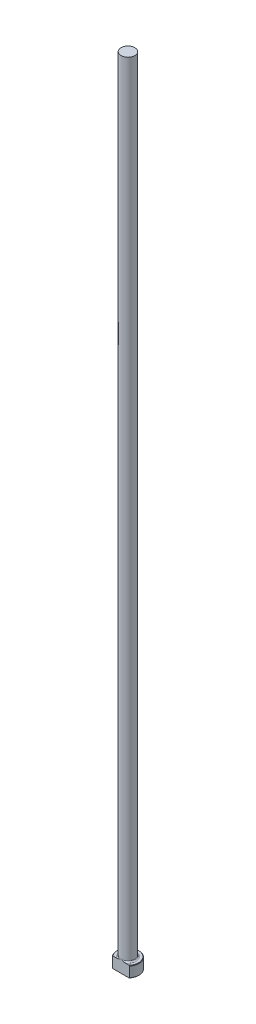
ISO-10303-21;
HEADER;
FILE_DESCRIPTION(('STEP AP214'),'2;1');
FILE_NAME('part.step','',(''),(''),'','','');
FILE_SCHEMA(('AUTOMOTIVE_DESIGN { 1 0 10303 214 1 1 1 1 }'));
ENDSEC;
DATA;
#1=APPLICATION_CONTEXT('core data for automotive mechanical design processes');
#2=APPLICATION_PROTOCOL_DEFINITION('international standard','automotive_design',2000,#1);
#3=PRODUCT_CONTEXT('',#1,'mechanical');
#4=PRODUCT('Part','Part','',(#3));
#5=PRODUCT_RELATED_PRODUCT_CATEGORY('part','',(#4));
#6=PRODUCT_DEFINITION_FORMATION('','',#4);
#7=PRODUCT_DEFINITION_CONTEXT('part definition',#1,'design');
#8=PRODUCT_DEFINITION('design','',#6,#7);
#9=PRODUCT_DEFINITION_SHAPE('','',#8);
#10=(LENGTH_UNIT() NAMED_UNIT(*) SI_UNIT(.MILLI.,.METRE.));
#11=(NAMED_UNIT(*) PLANE_ANGLE_UNIT() SI_UNIT($,.RADIAN.));
#12=(NAMED_UNIT(*) SI_UNIT($,.STERADIAN.) SOLID_ANGLE_UNIT());
#13=UNCERTAINTY_MEASURE_WITH_UNIT(LENGTH_MEASURE(1.E-05),#10,'distance_accuracy_value','');
#14=(GEOMETRIC_REPRESENTATION_CONTEXT(3) GLOBAL_UNCERTAINTY_ASSIGNED_CONTEXT((#13)) GLOBAL_UNIT_ASSIGNED_CONTEXT((#10,
#11,#12)) REPRESENTATION_CONTEXT('',''));
#15=CARTESIAN_POINT('',(0.,0.,0.));
#16=DIRECTION('',(0.,0.,1.));
#17=DIRECTION('',(1.,0.,0.));
#18=AXIS2_PLACEMENT_3D('',#15,#16,#17);
#19=CARTESIAN_POINT('',(0.,0.,0.));
#20=DIRECTION('',(0.,-1.,0.));
#21=DIRECTION('',(0.,0.,-1.));
#22=AXIS2_PLACEMENT_3D('',#19,#20,#21);
#23=PLANE('',#22);
#24=CARTESIAN_POINT('',(0.,0.,0.));
#25=DIRECTION('',(0.,-1.,0.));
#26=DIRECTION('',(0.,0.,-1.));
#27=AXIS2_PLACEMENT_3D('',#24,#25,#26);
#28=CIRCLE('',#27,6.09599999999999);
#29=CARTESIAN_POINT('',(-4.62711999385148,0.,3.96874999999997));
#30=VERTEX_POINT('',#29);
#31=CARTESIAN_POINT('',(4.62711999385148,0.,3.96874999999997));
#32=VERTEX_POINT('',#31);
#33=EDGE_CURVE('E98',#30,#32,#28,.T.);
#34=ORIENTED_EDGE('',*,*,#33,.T.);
#35=DIRECTION('',(-1.,0.,0.));
#36=VECTOR('',#35,1.);
#37=CARTESIAN_POINT('',(-4.95696716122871,0.,3.96874999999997));
#38=LINE('',#37,#36);
#39=EDGE_CURVE('E83',#32,#30,#38,.T.);
#40=ORIENTED_EDGE('',*,*,#39,.T.);
#41=EDGE_LOOP('',(#34,#40));
#42=FACE_BOUND('',#41,.T.);
#43=ADVANCED_FACE('F32',(#42),#23,.T.);
#44=CARTESIAN_POINT('',(0.,259.958771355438,0.));
#45=DIRECTION('',(0.,1.,0.));
#46=DIRECTION('',(0.,0.,1.));
#47=AXIS2_PLACEMENT_3D('',#44,#45,#46);
#48=CYLINDRICAL_SURFACE('',#47,6.34999999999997);
#49=CARTESIAN_POINT('',(0.,6.09599999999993,0.));
#50=DIRECTION('',(0.,1.,0.));
#51=DIRECTION('',(0.,0.,1.));
#52=AXIS2_PLACEMENT_3D('',#49,#50,#51);
#53=CIRCLE('',#52,6.34999999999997);
#54=CARTESIAN_POINT('',(-4.95696716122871,6.09599999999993,3.96874999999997));
#55=VERTEX_POINT('',#54);
#56=CARTESIAN_POINT('',(4.95696716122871,6.09599999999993,3.96874999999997));
#57=VERTEX_POINT('',#56);
#58=EDGE_CURVE('E104',#55,#57,#53,.F.);
#59=ORIENTED_EDGE('',*,*,#58,.T.);
#60=DIRECTION('',(0.,-1.,0.));
#61=VECTOR('',#60,1.);
#62=CARTESIAN_POINT('',(4.95696716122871,457.2,3.96874999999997));
#63=LINE('',#62,#61);
#64=CARTESIAN_POINT('',(4.95696716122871,0.253999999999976,3.96874999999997));
#65=VERTEX_POINT('',#64);
#66=EDGE_CURVE('E183',#57,#65,#63,.T.);
#67=ORIENTED_EDGE('',*,*,#66,.T.);
#68=CARTESIAN_POINT('',(0.,0.253999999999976,0.));
#69=DIRECTION('',(0.,-1.,0.));
#70=DIRECTION('',(0.,0.,-1.));
#71=AXIS2_PLACEMENT_3D('',#68,#69,#70);
#72=CIRCLE('',#71,6.34999999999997);
#73=CARTESIAN_POINT('',(-4.95696716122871,0.253999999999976,3.96874999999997));
#74=VERTEX_POINT('',#73);
#75=EDGE_CURVE('E100',#65,#74,#72,.F.);
#76=ORIENTED_EDGE('',*,*,#75,.T.);
#77=DIRECTION('',(0.,-1.,0.));
#78=VECTOR('',#77,1.);
#79=CARTESIAN_POINT('',(-4.95696716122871,457.2,3.96874999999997));
#80=LINE('',#79,#78);
#81=EDGE_CURVE('E93',#55,#74,#80,.T.);
#82=ORIENTED_EDGE('',*,*,#81,.F.);
#83=EDGE_LOOP('',(#59,#67,#76,#82));
#84=FACE_BOUND('',#83,.T.);
#85=ADVANCED_FACE('F158',(#84),#48,.T.);
#86=CARTESIAN_POINT('',(-6.34999999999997,6.35,0.));
#87=DIRECTION('',(0.,1.,0.));
#88=DIRECTION('',(0.,0.,1.));
#89=AXIS2_PLACEMENT_3D('',#86,#87,#88);
#90=PLANE('',#89);
#91=CARTESIAN_POINT('',(0.,6.35,0.));
#92=DIRECTION('',(0.,1.,0.));
#93=DIRECTION('',(0.,0.,1.));
#94=AXIS2_PLACEMENT_3D('',#91,#92,#93);
#95=CIRCLE('',#94,6.09599999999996);
#96=CARTESIAN_POINT('',(4.62711999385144,6.35,3.96874999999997));
#97=VERTEX_POINT('',#96);
#98=CARTESIAN_POINT('',(-4.62711999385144,6.35,3.96874999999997));
#99=VERTEX_POINT('',#98);
#100=EDGE_CURVE('E178',#97,#99,#95,.T.);
#101=ORIENTED_EDGE('',*,*,#100,.T.);
#102=DIRECTION('',(1.,0.,0.));
#103=VECTOR('',#102,1.);
#104=CARTESIAN_POINT('',(-6.34999999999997,6.35,3.96874999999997));
#105=LINE('',#104,#103);
#106=CARTESIAN_POINT('',(-2.57468813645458,6.35000000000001,3.96874999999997));
#107=VERTEX_POINT('',#106);
#108=EDGE_CURVE('E57',#99,#107,#105,.T.);
#109=ORIENTED_EDGE('',*,*,#108,.T.);
#110=CARTESIAN_POINT('',(0.,6.35,0.));
#111=DIRECTION('',(0.,1.,0.));
#112=DIRECTION('',(0.,0.,1.));
#113=AXIS2_PLACEMENT_3D('',#110,#111,#112);
#114=CIRCLE('',#113,4.73074999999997);
#115=CARTESIAN_POINT('',(2.57468813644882,6.35000000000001,3.96874999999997));
#116=VERTEX_POINT('',#115);
#117=EDGE_CURVE('E107',#107,#116,#114,.F.);
#118=ORIENTED_EDGE('',*,*,#117,.T.);
#119=EDGE_CURVE('E136',#116,#97,#105,.T.);
#120=ORIENTED_EDGE('',*,*,#119,.T.);
#121=EDGE_LOOP('',(#101,#109,#118,#120));
#122=FACE_BOUND('',#121,.T.);
#123=ADVANCED_FACE('F147',(#122),#90,.T.);
#124=CARTESIAN_POINT('',(0.,6.35000000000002,0.));
#125=DIRECTION('',(0.,-1.,0.));
#126=DIRECTION('',(0.,0.,-1.));
#127=AXIS2_PLACEMENT_3D('',#124,#125,#126);
#128=CONICAL_SURFACE('',#127,6.09599999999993,0.785398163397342);
#129=ORIENTED_EDGE('',*,*,#58,.F.);
#130=CARTESIAN_POINT('',(-10.9074797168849,0.838929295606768,3.96874999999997));
#131=CARTESIAN_POINT('',(-10.7362098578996,0.99987353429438,3.96874999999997));
#132=CARTESIAN_POINT('',(-10.5647219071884,1.16058556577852,3.96874999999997));
#133=CARTESIAN_POINT('',(-10.2212389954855,1.48146888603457,3.96874999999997));
#134=CARTESIAN_POINT('',(-10.0492440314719,1.64164017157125,3.96874999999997));
#135=CARTESIAN_POINT('',(-9.53215723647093,2.12144657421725,3.96874999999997));
#136=CARTESIAN_POINT('',(-9.18620012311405,2.44015148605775,3.96874999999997));
#137=CARTESIAN_POINT('',(-8.48250908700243,3.08209947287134,3.96874999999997));
#138=CARTESIAN_POINT('',(-8.12469692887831,3.40525689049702,3.96874999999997));
#139=CARTESIAN_POINT('',(-7.40476794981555,4.04632494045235,3.96874999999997));
#140=CARTESIAN_POINT('',(-7.04265387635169,4.36423864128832,3.96874999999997));
#141=CARTESIAN_POINT('',(-6.49464785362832,4.83529502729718,3.96874999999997));
#142=CARTESIAN_POINT('',(-6.31122194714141,4.99130476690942,3.96874999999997));
#143=CARTESIAN_POINT('',(-5.94233504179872,5.30091560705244,3.96874999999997));
#144=CARTESIAN_POINT('',(-5.75687398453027,5.45451663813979,3.96874999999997));
#145=CARTESIAN_POINT('',(-5.38307682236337,5.75894505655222,3.96874999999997));
#146=CARTESIAN_POINT('',(-5.19473578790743,5.90976640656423,3.96874999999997));
#147=CARTESIAN_POINT('',(-4.81490900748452,6.20737957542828,3.96874999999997));
#148=CARTESIAN_POINT('',(-4.6234235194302,6.354171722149,3.96874999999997));
#149=CARTESIAN_POINT('',(-4.23840402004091,6.64094245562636,3.96874999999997));
#150=CARTESIAN_POINT('',(-4.04491037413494,6.78097497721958,3.96874999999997));
#151=CARTESIAN_POINT('',(-3.65282433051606,7.05394467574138,3.96874999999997));
#152=CARTESIAN_POINT('',(-3.45422994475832,7.18687902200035,3.96874999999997));
#153=CARTESIAN_POINT('',(-3.0513063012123,7.44227984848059,3.96874999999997));
#154=CARTESIAN_POINT('',(-2.84699866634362,7.56478015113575,3.96874999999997));
#155=CARTESIAN_POINT('',(-2.43048905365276,7.79538986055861,3.96874999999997));
#156=CARTESIAN_POINT('',(-2.21829552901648,7.90351413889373,3.96874999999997));
#157=CARTESIAN_POINT('',(-1.88022874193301,8.05571524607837,3.96874999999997));
#158=CARTESIAN_POINT('',(-1.75760714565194,8.10699294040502,3.96874999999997));
#159=CARTESIAN_POINT('',(-1.50924598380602,8.2015208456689,3.96874999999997));
#160=CARTESIAN_POINT('',(-1.38350591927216,8.24476976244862,3.96874999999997));
#161=CARTESIAN_POINT('',(-1.12977963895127,8.32133629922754,3.96874999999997));
#162=CARTESIAN_POINT('',(-1.00181028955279,8.35470906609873,3.96874999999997));
#163=CARTESIAN_POINT('',(-0.743427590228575,8.41019049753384,3.96874999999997));
#164=CARTESIAN_POINT('',(-0.613014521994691,8.43230045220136,3.96874999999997));
#165=CARTESIAN_POINT('',(-0.348820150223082,8.46413643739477,3.96874999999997));
#166=CARTESIAN_POINT('',(-0.215017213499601,8.47368667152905,3.96874999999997));
#167=CARTESIAN_POINT('',(0.0528592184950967,8.47915710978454,3.96874999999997));
#168=CARTESIAN_POINT('',(0.186932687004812,8.47507860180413,3.96874999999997));
#169=CARTESIAN_POINT('',(0.454438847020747,8.45355129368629,3.96874999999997));
#170=CARTESIAN_POINT('',(0.587867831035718,8.4360572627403,3.96874999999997));
#171=CARTESIAN_POINT('',(0.852531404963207,8.38880841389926,3.96874999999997));
#172=CARTESIAN_POINT('',(0.983765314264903,8.35904986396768,3.96874999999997));
#173=CARTESIAN_POINT('',(1.28880023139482,8.27664707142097,3.96874999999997));
#174=CARTESIAN_POINT('',(1.4614132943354,8.21963783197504,3.96874999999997));
#175=CARTESIAN_POINT('',(1.8009000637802,8.0906027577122,3.96874999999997));
#176=CARTESIAN_POINT('',(1.96777052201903,8.01856858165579,3.96874999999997));
#177=CARTESIAN_POINT('',(2.21492486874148,7.90160331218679,3.96874999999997));
#178=CARTESIAN_POINT('',(2.29724213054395,7.86087235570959,3.96874999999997));
#179=CARTESIAN_POINT('',(2.46058693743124,7.77689381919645,3.96874999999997));
#180=CARTESIAN_POINT('',(2.54161446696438,7.73364620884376,3.96874999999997));
#181=CARTESIAN_POINT('',(2.70243717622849,7.64499560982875,3.96874999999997));
#182=CARTESIAN_POINT('',(2.78223280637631,7.59959343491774,3.96874999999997));
#183=CARTESIAN_POINT('',(2.94071403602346,7.50690571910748,3.96874999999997));
#184=CARTESIAN_POINT('',(3.01939969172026,7.4596202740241,3.96874999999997));
#185=CARTESIAN_POINT('',(3.28991241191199,7.29319146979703,3.96874999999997));
#186=CARTESIAN_POINT('',(3.47920753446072,7.16992469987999,3.96874999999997));
#187=CARTESIAN_POINT('',(3.85299575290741,6.91628466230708,3.96874999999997));
#188=CARTESIAN_POINT('',(4.03748740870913,6.78590929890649,3.96874999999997));
#189=CARTESIAN_POINT('',(4.40281517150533,6.51977921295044,3.96874999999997));
#190=CARTESIAN_POINT('',(4.58364746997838,6.38401928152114,3.96874999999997));
#191=CARTESIAN_POINT('',(4.94222498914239,6.10853910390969,3.96874999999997));
#192=CARTESIAN_POINT('',(5.1199705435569,5.96881929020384,3.96874999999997));
#193=CARTESIAN_POINT('',(5.47373559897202,5.68571433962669,3.96874999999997));
#194=CARTESIAN_POINT('',(5.64974474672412,5.54231629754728,3.96874999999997));
#195=CARTESIAN_POINT('',(5.99974206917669,5.25307243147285,3.96874999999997));
#196=CARTESIAN_POINT('',(6.1737301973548,5.1072265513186,3.96874999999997));
#197=CARTESIAN_POINT('',(6.69302814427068,4.66694445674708,3.96874999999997));
#198=CARTESIAN_POINT('',(7.03587209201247,4.36960132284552,3.96874999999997));
#199=CARTESIAN_POINT('',(7.67698172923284,3.80499574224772,3.96874999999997));
#200=CARTESIAN_POINT('',(7.97575257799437,3.53830334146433,3.96874999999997));
#201=CARTESIAN_POINT('',(8.57066794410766,3.00191368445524,3.96874999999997));
#202=CARTESIAN_POINT('',(8.86681204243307,2.73221596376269,3.96874999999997));
#203=CARTESIAN_POINT('',(9.45462121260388,2.19284079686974,3.96874999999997));
#204=CARTESIAN_POINT('',(9.74630307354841,1.92318161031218,3.96874999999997));
#205=CARTESIAN_POINT('',(10.3280138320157,1.38219972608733,3.96874999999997));
#206=CARTESIAN_POINT('',(10.6180430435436,1.11087736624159,3.96874999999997));
#207=CARTESIAN_POINT('',(10.9074797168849,0.838929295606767,3.96874999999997));
#208=B_SPLINE_CURVE_WITH_KNOTS('',3,(#130,#131,#132,#133,#134,#135,#136,#137,#138,#139,#140,
#141,#142,#143,#144,#145,#146,#147,#148,#149,#150,#151,#152,#153,#154,#155,#156,#157,#158,#159,
#160,#161,#162,#163,#164,#165,#166,#167,#168,#169,#170,#171,#172,#173,#174,#175,#176,#177,#178,
#179,#180,#181,#182,#183,#184,#185,#186,#187,#188,#189,#190,#191,#192,#193,#194,#195,#196,#197,
#198,#199,#200,#201,#202,#203,#204,#205,#206,#207),.UNSPECIFIED.,.F.,.F.,(4,2,2,2,2,2,2,2,2,2,2,
2,2,2,2,2,2,2,2,2,2,2,2,2,2,2,2,2,2,2,2,2,2,2,2,2,2,2,4),(0.,0.705072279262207,1.41014876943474,
2.82127665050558,4.26767292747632,5.71319041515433,6.43557153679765,7.15797344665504,
7.88179359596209,8.60555467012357,9.32198841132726,10.0387057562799,10.753003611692,
11.4665567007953,11.8650702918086,12.2636480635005,12.6599563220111,13.0562191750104,
13.457971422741,13.859685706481,14.2627603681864,14.665957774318,15.2103582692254,
15.7550618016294,16.0305566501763,16.3060548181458,16.5814497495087,16.856830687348,
17.5342490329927,18.2118681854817,18.89015964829,19.5683773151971,20.2494368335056,
20.930511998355,22.2918881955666,23.4933255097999,24.6949511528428,25.8866442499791,
27.0781028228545),.UNSPECIFIED.);
#209=EDGE_CURVE('E135',#55,#99,#208,.T.);
#210=ORIENTED_EDGE('',*,*,#209,.T.);
#211=ORIENTED_EDGE('',*,*,#100,.F.);
#212=EDGE_CURVE('E127',#97,#57,#208,.T.);
#213=ORIENTED_EDGE('',*,*,#212,.T.);
#214=EDGE_LOOP('',(#129,#210,#211,#213));
#215=FACE_BOUND('',#214,.T.);
#216=ADVANCED_FACE('F143',(#215),#128,.T.);
#217=CARTESIAN_POINT('',(0.,0.253999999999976,0.));
#218=DIRECTION('',(0.,1.,0.));
#219=DIRECTION('',(0.,0.,1.));
#220=AXIS2_PLACEMENT_3D('',#217,#218,#219);
#221=CONICAL_SURFACE('',#220,6.34999999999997,0.785398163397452);
#222=ORIENTED_EDGE('',*,*,#75,.F.);
#223=CARTESIAN_POINT('',(10.9074797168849,5.51107070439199,3.96874999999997));
#224=CARTESIAN_POINT('',(10.7362098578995,5.35012646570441,3.96874999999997));
#225=CARTESIAN_POINT('',(10.5647219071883,5.18941443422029,3.96874999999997));
#226=CARTESIAN_POINT('',(10.2212389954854,4.86853111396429,3.96874999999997));
#227=CARTESIAN_POINT('',(10.0492440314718,4.70835982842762,3.96874999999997));
#228=CARTESIAN_POINT('',(9.53215723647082,4.22855342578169,3.96874999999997));
#229=CARTESIAN_POINT('',(9.18620012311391,3.90984851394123,3.96874999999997));
#230=CARTESIAN_POINT('',(8.48250908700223,3.26790052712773,3.96874999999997));
#231=CARTESIAN_POINT('',(8.12469692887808,2.94474310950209,3.96874999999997));
#232=CARTESIAN_POINT('',(7.40476794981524,2.30367505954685,3.96874999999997));
#233=CARTESIAN_POINT('',(7.04265387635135,1.98576135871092,3.96874999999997));
#234=CARTESIAN_POINT('',(6.49464785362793,1.51470497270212,3.96874999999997));
#235=CARTESIAN_POINT('',(6.311221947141,1.3586952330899,3.96874999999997));
#236=CARTESIAN_POINT('',(5.94233504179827,1.04908439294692,3.96874999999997));
#237=CARTESIAN_POINT('',(5.75687398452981,0.895483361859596,3.96874999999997));
#238=CARTESIAN_POINT('',(5.38307682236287,0.59105494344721,3.96874999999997));
#239=CARTESIAN_POINT('',(5.19473578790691,0.440233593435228,3.96874999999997));
#240=CARTESIAN_POINT('',(4.81490900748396,0.142620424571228,3.96874999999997));
#241=CARTESIAN_POINT('',(4.62342351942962,-0.00417172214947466,3.96874999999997));
#242=CARTESIAN_POINT('',(4.23840402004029,-0.290942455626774,3.96874999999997));
#243=CARTESIAN_POINT('',(4.04491037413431,-0.430974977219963,3.96874999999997));
#244=CARTESIAN_POINT('',(3.6528243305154,-0.703944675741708,3.96874999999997));
#245=CARTESIAN_POINT('',(3.45422994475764,-0.836879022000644,3.96874999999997));
#246=CARTESIAN_POINT('',(3.05130630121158,-1.09227984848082,3.96874999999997));
#247=CARTESIAN_POINT('',(2.84699866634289,-1.21478015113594,3.96874999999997));
#248=CARTESIAN_POINT('',(2.43048905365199,-1.44538986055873,3.96874999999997));
#249=CARTESIAN_POINT('',(2.2182955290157,-1.55351413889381,3.96874999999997));
#250=CARTESIAN_POINT('',(1.8802287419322,-1.70571524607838,3.96874999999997));
#251=CARTESIAN_POINT('',(1.75760714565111,-1.75699294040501,3.96874999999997));
#252=CARTESIAN_POINT('',(1.50924598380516,-1.85152084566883,3.96874999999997));
#253=CARTESIAN_POINT('',(1.3835059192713,-1.89476976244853,3.96874999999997));
#254=CARTESIAN_POINT('',(1.12977963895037,-1.97133629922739,3.96874999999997));
#255=CARTESIAN_POINT('',(1.00181028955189,-2.00470906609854,3.96874999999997));
#256=CARTESIAN_POINT('',(0.743427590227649,-2.06019049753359,3.96874999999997));
#257=CARTESIAN_POINT('',(0.613014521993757,-2.08230045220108,3.96874999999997));
#258=CARTESIAN_POINT('',(0.348820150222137,-2.11413643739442,3.96874999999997));
#259=CARTESIAN_POINT('',(0.215017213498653,-2.12368667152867,3.96874999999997));
#260=CARTESIAN_POINT('',(-0.0528592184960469,-2.12915710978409,3.96874999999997));
#261=CARTESIAN_POINT('',(-0.186932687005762,-2.12507860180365,3.96874999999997));
#262=CARTESIAN_POINT('',(-0.454438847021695,-2.10355129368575,3.96874999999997));
#263=CARTESIAN_POINT('',(-0.587867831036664,-2.08605726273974,3.96874999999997));
#264=CARTESIAN_POINT('',(-0.852531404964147,-2.03880841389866,3.96874999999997));
#265=CARTESIAN_POINT('',(-0.98376531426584,-2.00904986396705,3.96874999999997));
#266=CARTESIAN_POINT('',(-1.28880023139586,-1.92664707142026,3.96874999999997));
#267=CARTESIAN_POINT('',(-1.46141329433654,-1.86963783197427,3.96874999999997));
#268=CARTESIAN_POINT('',(-1.80090006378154,-1.7406027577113,3.96874999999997));
#269=CARTESIAN_POINT('',(-1.96777052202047,-1.66856858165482,3.96874999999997));
#270=CARTESIAN_POINT('',(-2.21492486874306,-1.55160331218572,3.96874999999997));
#271=CARTESIAN_POINT('',(-2.29724213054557,-1.51087235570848,3.96874999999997));
#272=CARTESIAN_POINT('',(-2.46058693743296,-1.42689381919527,3.96874999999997));
#273=CARTESIAN_POINT('',(-2.54161446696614,-1.38364620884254,3.96874999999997));
#274=CARTESIAN_POINT('',(-2.70243717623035,-1.29499560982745,3.96874999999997));
#275=CARTESIAN_POINT('',(-2.78223280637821,-1.24959343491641,3.96874999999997));
#276=CARTESIAN_POINT('',(-2.94071403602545,-1.15690571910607,3.96874999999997));
#277=CARTESIAN_POINT('',(-3.0193996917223,-1.10962027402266,3.96874999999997));
#278=CARTESIAN_POINT('',(-3.28991241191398,-0.943191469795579,3.96874999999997));
#279=CARTESIAN_POINT('',(-3.47920753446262,-0.819924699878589,3.96874999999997));
#280=CARTESIAN_POINT('',(-3.85299575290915,-0.566284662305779,3.96874999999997));
#281=CARTESIAN_POINT('',(-4.03748740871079,-0.435909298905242,3.96874999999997));
#282=CARTESIAN_POINT('',(-4.40281517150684,-0.169779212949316,3.96874999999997));
#283=CARTESIAN_POINT('',(-4.58364746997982,-0.0340192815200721,3.96874999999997));
#284=CARTESIAN_POINT('',(-4.94222498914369,0.241460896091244,3.96874999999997));
#285=CARTESIAN_POINT('',(-5.11997054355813,0.381180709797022,3.96874999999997));
#286=CARTESIAN_POINT('',(-5.47373559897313,0.664285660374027,3.96874999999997));
#287=CARTESIAN_POINT('',(-5.64974474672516,0.807683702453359,3.96874999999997));
#288=CARTESIAN_POINT('',(-5.9997420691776,1.09692756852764,3.96874999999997));
#289=CARTESIAN_POINT('',(-6.17373019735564,1.24277344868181,3.96874999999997));
#290=CARTESIAN_POINT('',(-6.69302814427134,1.68305554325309,3.96874999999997));
#291=CARTESIAN_POINT('',(-7.03587209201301,1.98039867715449,3.96874999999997));
#292=CARTESIAN_POINT('',(-7.67698172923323,2.54500425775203,3.96874999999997));
#293=CARTESIAN_POINT('',(-7.97575257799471,2.81169665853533,3.96874999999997));
#294=CARTESIAN_POINT('',(-8.57066794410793,3.34808631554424,3.96874999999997));
#295=CARTESIAN_POINT('',(-8.8668120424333,3.61778403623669,3.96874999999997));
#296=CARTESIAN_POINT('',(-9.45462121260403,4.15715920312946,3.96874999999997));
#297=CARTESIAN_POINT('',(-9.74630307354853,4.42681838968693,3.96874999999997));
#298=CARTESIAN_POINT('',(-10.3280138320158,4.9678002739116,3.96874999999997));
#299=CARTESIAN_POINT('',(-10.6180430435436,5.23912263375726,3.96874999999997));
#300=CARTESIAN_POINT('',(-10.9074797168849,5.51107070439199,3.96874999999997));
#301=B_SPLINE_CURVE_WITH_KNOTS('',3,(#223,#224,#225,#226,#227,#228,#229,#230,#231,#232,#233,
#234,#235,#236,#237,#238,#239,#240,#241,#242,#243,#244,#245,#246,#247,#248,#249,#250,#251,#252,
#253,#254,#255,#256,#257,#258,#259,#260,#261,#262,#263,#264,#265,#266,#267,#268,#269,#270,#271,
#272,#273,#274,#275,#276,#277,#278,#279,#280,#281,#282,#283,#284,#285,#286,#287,#288,#289,#290,
#291,#292,#293,#294,#295,#296,#297,#298,#299,#300),.UNSPECIFIED.,.F.,.F.,(4,2,2,2,2,2,2,2,2,2,2,
2,2,2,2,2,2,2,2,2,2,2,2,2,2,2,2,2,2,2,2,2,2,2,2,2,2,2,4),(0.,0.705072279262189,1.4101487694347,
2.82127665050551,4.26767292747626,5.71319041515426,6.43557153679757,7.15797344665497,
7.88179359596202,8.6055546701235,9.32198841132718,10.0387057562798,10.7530036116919,
11.4665567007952,11.8650702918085,12.2636480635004,12.659956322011,13.0562191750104,
13.4579714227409,13.8596857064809,14.2627603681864,14.6659577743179,15.2103582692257,
15.7550618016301,16.0305566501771,16.3060548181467,16.5814497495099,16.8568306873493,
17.5342490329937,18.2118681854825,18.8901596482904,19.5683773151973,20.2494368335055,
20.9305119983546,22.2918881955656,23.4933255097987,24.6949511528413,25.8866442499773,
27.0781028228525),.UNSPECIFIED.);
#302=EDGE_CURVE('E86',#65,#32,#301,.T.);
#303=ORIENTED_EDGE('',*,*,#302,.T.);
#304=ORIENTED_EDGE('',*,*,#33,.F.);
#305=EDGE_CURVE('E89',#30,#74,#301,.T.);
#306=ORIENTED_EDGE('',*,*,#305,.T.);
#307=EDGE_LOOP('',(#222,#303,#304,#306));
#308=FACE_BOUND('',#307,.T.);
#309=ADVANCED_FACE('F97',(#308),#221,.T.);
#310=CARTESIAN_POINT('',(0.,7.11200000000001,0.));
#311=DIRECTION('',(0.,1.,0.));
#312=DIRECTION('',(0.,0.,1.));
#313=AXIS2_PLACEMENT_3D('',#310,#311,#312);
#314=TOROIDAL_SURFACE('',#313,4.73074999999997,0.762);
#315=CARTESIAN_POINT('',(0.,7.11200000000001,3.96874999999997));
#316=CARTESIAN_POINT('',(2.72452874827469E-10,7.11200100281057,3.96874999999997));
#317=CARTESIAN_POINT('',(1.89097572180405E-07,7.11200200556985,3.96874999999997));
#318=CARTESIAN_POINT('',(7.99901127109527E-07,7.11200394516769,3.96874999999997));
#319=CARTESIAN_POINT('',(1.2266662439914E-06,7.11200488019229,3.96874999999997));
#320=CARTESIAN_POINT('',(2.25601477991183E-06,7.11200673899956,3.96874999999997));
#321=CARTESIAN_POINT('',(2.86938873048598E-06,7.11200765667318,3.96874999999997));
#322=CARTESIAN_POINT('',(4.2009410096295E-06,7.11200939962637,3.96874999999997));
#323=CARTESIAN_POINT('',(4.91843246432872E-06,7.11201022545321,3.96874999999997));
#324=CARTESIAN_POINT('',(7.4625804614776E-06,7.11201295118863,3.96874999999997));
#325=CARTESIAN_POINT('',(9.42693843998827E-06,7.11201472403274,3.96874999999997));
#326=CARTESIAN_POINT('',(1.35156238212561E-05,7.11201792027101,3.96874999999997));
#327=CARTESIAN_POINT('',(1.56334419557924E-05,7.11201935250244,3.96874999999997));
#328=CARTESIAN_POINT('',(2.37794366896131E-05,7.11202462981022,3.96874999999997));
#329=CARTESIAN_POINT('',(3.00000425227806E-05,7.11202818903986,3.96874999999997));
#330=CARTESIAN_POINT('',(4.23604379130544E-05,7.11203410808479,3.96874999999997));
#331=CARTESIAN_POINT('',(4.84662901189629E-05,7.11203654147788,3.96874999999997));
#332=CARTESIAN_POINT('',(7.41361994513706E-05,7.11204669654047,3.96874999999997));
#333=CARTESIAN_POINT('',(9.37464432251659E-05,7.11205427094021,3.96874999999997));
#334=CARTESIAN_POINT('',(0.000130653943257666,7.11206661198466,3.96874999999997));
#335=CARTESIAN_POINT('',(0.00014786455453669,7.11207162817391,3.96874999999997));
#336=CARTESIAN_POINT('',(0.000271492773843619,7.11211085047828,3.96874999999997));
#337=CARTESIAN_POINT('',(0.000372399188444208,7.11216017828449,3.96874999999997));
#338=CARTESIAN_POINT('',(0.000762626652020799,7.11234384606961,3.96874999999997));
#339=CARTESIAN_POINT('',(0.00105578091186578,7.1124669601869,3.96874999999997));
#340=CARTESIAN_POINT('',(0.00218658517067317,7.11294905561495,3.96874999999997));
#341=CARTESIAN_POINT('',(0.00302029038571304,7.11331980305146,3.96874999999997));
#342=CARTESIAN_POINT('',(0.00641326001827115,7.11482126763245,3.96874999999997));
#343=CARTESIAN_POINT('',(0.00897690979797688,7.1159386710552,3.96874999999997));
#344=CARTESIAN_POINT('',(0.0431521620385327,7.13084393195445,3.96874999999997));
#345=CARTESIAN_POINT('',(0.0747329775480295,7.14472589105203,3.96874999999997));
#346=CARTESIAN_POINT('',(0.138371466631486,7.17259981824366,3.96874999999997));
#347=CARTESIAN_POINT('',(0.170429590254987,7.18659058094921,3.96874999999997));
#348=CARTESIAN_POINT('',(0.263897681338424,7.22728018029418,3.96874999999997));
#349=CARTESIAN_POINT('',(0.32534291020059,7.25390148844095,3.96874999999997));
#350=CARTESIAN_POINT('',(0.45545149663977,7.30966012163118,3.96874999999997));
#351=CARTESIAN_POINT('',(0.524140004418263,7.33873873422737,3.96874999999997));
#352=CARTESIAN_POINT('',(0.662588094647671,7.39626071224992,3.96874999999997));
#353=CARTESIAN_POINT('',(0.732351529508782,7.42469485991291,3.96874999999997));
#354=CARTESIAN_POINT('',(0.854677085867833,7.47322946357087,3.96874999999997));
#355=CARTESIAN_POINT('',(0.907124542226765,7.49361793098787,3.96874999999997));
#356=CARTESIAN_POINT('',(1.01222990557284,7.53345950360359,3.96874999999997));
#357=CARTESIAN_POINT('',(1.06488701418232,7.55291472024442,3.96874999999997));
#358=CARTESIAN_POINT('',(1.22118224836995,7.60890100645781,3.96874999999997));
#359=CARTESIAN_POINT('',(1.32536392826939,7.64394780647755,3.96874999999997));
#360=CARTESIAN_POINT('',(1.51475689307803,7.70222633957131,3.96874999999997));
#361=CARTESIAN_POINT('',(1.59966831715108,7.72642606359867,3.96874999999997));
#362=CARTESIAN_POINT('',(1.77115576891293,7.77055798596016,3.96874999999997));
#363=CARTESIAN_POINT('',(1.85773874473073,7.79046358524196,3.96874999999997));
#364=CARTESIAN_POINT('',(2.03663433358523,7.8256694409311,3.96874999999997));
#365=CARTESIAN_POINT('',(2.12900742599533,7.84066973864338,3.96874999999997));
#366=CARTESIAN_POINT('',(2.31450882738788,7.86300878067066,3.96874999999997));
#367=CARTESIAN_POINT('',(2.40763490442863,7.87036510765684,3.96874999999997));
#368=CARTESIAN_POINT('',(2.58622461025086,7.87533872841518,3.96874999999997));
#369=CARTESIAN_POINT('',(2.67166229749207,7.87373524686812,3.96874999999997));
#370=CARTESIAN_POINT('',(2.84116133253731,7.86073590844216,3.96874999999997));
#371=CARTESIAN_POINT('',(2.92522821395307,7.84942227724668,3.96874999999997));
#372=CARTESIAN_POINT('',(3.09260159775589,7.81445437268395,3.96874999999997));
#373=CARTESIAN_POINT('',(3.17586039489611,7.79056108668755,3.96874999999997));
#374=CARTESIAN_POINT('',(3.33637449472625,7.72711703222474,3.96874999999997));
#375=CARTESIAN_POINT('',(3.41365062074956,7.6876237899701,3.96874999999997));
#376=CARTESIAN_POINT('',(3.51798857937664,7.61566535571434,3.96874999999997));
#377=CARTESIAN_POINT('',(3.55006318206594,7.59045187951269,3.96874999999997));
#378=CARTESIAN_POINT('',(3.6102188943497,7.53557765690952,3.96874999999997));
#379=CARTESIAN_POINT('',(3.63830099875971,7.50591802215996,3.96874999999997));
#380=CARTESIAN_POINT('',(3.68933162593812,7.44181271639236,3.96874999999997));
#381=CARTESIAN_POINT('',(3.7122145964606,7.40731395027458,3.96874999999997));
#382=CARTESIAN_POINT('',(3.75063172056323,7.3344255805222,3.96874999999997));
#383=CARTESIAN_POINT('',(3.76617854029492,7.29604282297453,3.96874999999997));
#384=CARTESIAN_POINT('',(3.7867432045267,7.22260269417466,3.96874999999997));
#385=CARTESIAN_POINT('',(3.79297266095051,7.18788564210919,3.96874999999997));
#386=CARTESIAN_POINT('',(3.79840708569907,7.11791009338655,3.96874999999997));
#387=CARTESIAN_POINT('',(3.79761729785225,7.08265202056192,3.96874999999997));
#388=CARTESIAN_POINT('',(3.7897274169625,7.01808169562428,3.96874999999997));
#389=CARTESIAN_POINT('',(3.78356056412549,6.98864967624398,3.96874999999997));
#390=CARTESIAN_POINT('',(3.76657344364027,6.93117296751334,3.96874999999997));
#391=CARTESIAN_POINT('',(3.75575305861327,6.90312831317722,3.96874999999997));
#392=CARTESIAN_POINT('',(3.72949416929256,6.84779976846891,3.96874999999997));
#393=CARTESIAN_POINT('',(3.713874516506,6.82060268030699,3.96874999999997));
#394=CARTESIAN_POINT('',(3.67898159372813,6.76868386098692,3.96874999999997));
#395=CARTESIAN_POINT('',(3.6597066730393,6.74396325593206,3.96874999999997));
#396=CARTESIAN_POINT('',(3.60698815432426,6.68446341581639,3.96874999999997));
#397=CARTESIAN_POINT('',(3.57151931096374,6.65147423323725,3.96874999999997));
#398=CARTESIAN_POINT('',(3.49575447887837,6.59155388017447,3.96874999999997));
#399=CARTESIAN_POINT('',(3.45544429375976,6.56464122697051,3.96874999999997));
#400=CARTESIAN_POINT('',(3.35110964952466,6.50463027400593,3.96874999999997));
#401=CARTESIAN_POINT('',(3.2851315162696,6.47494717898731,3.96874999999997));
#402=CARTESIAN_POINT('',(3.1496628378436,6.42615277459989,3.96874999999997));
#403=CARTESIAN_POINT('',(3.08017671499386,6.40702850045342,3.96874999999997));
#404=CARTESIAN_POINT('',(2.95179922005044,6.38006601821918,3.96874999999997));
#405=CARTESIAN_POINT('',(2.89318763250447,6.37083647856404,3.96874999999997));
#406=CARTESIAN_POINT('',(2.77536712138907,6.35745547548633,3.96874999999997));
#407=CARTESIAN_POINT('',(2.71615776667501,6.35330798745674,3.96874999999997));
#408=CARTESIAN_POINT('',(2.53632384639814,6.34734840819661,3.96874999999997));
#409=CARTESIAN_POINT('',(2.41545754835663,6.35237783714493,3.96874999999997));
#410=CARTESIAN_POINT('',(2.21811250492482,6.3716785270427,3.96874999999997));
#411=CARTESIAN_POINT('',(2.14116511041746,6.38201761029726,3.96874999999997));
#412=CARTESIAN_POINT('',(1.98802972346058,6.40734893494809,3.96874999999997));
#413=CARTESIAN_POINT('',(1.9118417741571,6.42234143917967,3.96874999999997));
#414=CARTESIAN_POINT('',(1.6839709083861,6.47322550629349,3.96874999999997));
#415=CARTESIAN_POINT('',(1.53360062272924,6.5149500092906,3.96874999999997));
#416=CARTESIAN_POINT('',(1.24863432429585,6.60495823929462,3.96874999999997));
#417=CARTESIAN_POINT('',(1.11376371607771,6.65241192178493,3.96874999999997));
#418=CARTESIAN_POINT('',(0.847576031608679,6.75264930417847,3.96874999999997));
#419=CARTESIAN_POINT('',(0.716236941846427,6.80537521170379,3.96874999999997));
#420=CARTESIAN_POINT('',(0.544659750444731,6.87676192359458,3.96874999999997));
#421=CARTESIAN_POINT('',(0.503794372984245,6.89395286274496,3.96874999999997));
#422=CARTESIAN_POINT('',(0.421123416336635,6.92903262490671,3.96874999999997));
#423=CARTESIAN_POINT('',(0.37932061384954,6.94692803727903,3.96874999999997));
#424=CARTESIAN_POINT('',(0.308934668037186,6.97725002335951,3.96874999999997));
#425=CARTESIAN_POINT('',(0.280329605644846,6.98962609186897,3.96874999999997));
#426=CARTESIAN_POINT('',(0.223423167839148,7.0143301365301,3.96874999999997));
#427=CARTESIAN_POINT('',(0.195121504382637,7.02665744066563,3.96874999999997));
#428=CARTESIAN_POINT('',(0.141398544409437,7.05009288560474,3.96874999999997));
#429=CARTESIAN_POINT('',(0.115975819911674,7.06119805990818,3.96874999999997));
#430=CARTESIAN_POINT('',(0.0642235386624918,7.08387460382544,3.96874999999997));
#431=CARTESIAN_POINT('',(0.0378947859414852,7.09544818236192,3.96874999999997));
#432=CARTESIAN_POINT('',(0.00898087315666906,7.1080596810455,3.96874999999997));
#433=CARTESIAN_POINT('',(0.00642114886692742,7.1091753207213,3.96874999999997));
#434=CARTESIAN_POINT('',(0.00302915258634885,7.11067631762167,3.96874999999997));
#435=CARTESIAN_POINT('',(0.00219250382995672,7.11104837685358,3.96874999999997));
#436=CARTESIAN_POINT('',(0.0010579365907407,7.11153207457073,3.96874999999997));
#437=CARTESIAN_POINT('',(0.000763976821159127,7.11165552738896,3.96874999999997));
#438=CARTESIAN_POINT('',(0.000372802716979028,7.11183964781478,3.96874999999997));
#439=CARTESIAN_POINT('',(0.000271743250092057,7.111889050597,3.96874999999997));
#440=CARTESIAN_POINT('',(0.000147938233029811,7.11192831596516,3.96874999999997));
#441=CARTESIAN_POINT('',(0.000130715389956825,7.11193333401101,3.96874999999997));
#442=CARTESIAN_POINT('',(9.3781335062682E-05,7.11194568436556,3.96874999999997));
#443=CARTESIAN_POINT('',(7.41570977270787E-05,7.11195326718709,3.96874999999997));
#444=CARTESIAN_POINT('',(4.84714569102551E-05,7.11196343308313,3.96874999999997));
#445=CARTESIAN_POINT('',(4.23636191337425E-05,7.11196586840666,3.96874999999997));
#446=CARTESIAN_POINT('',(2.99995408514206E-05,7.11197179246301,3.96874999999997));
#447=CARTESIAN_POINT('',(2.37773032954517E-05,7.11197535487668,3.96874999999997));
#448=CARTESIAN_POINT('',(1.5629804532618E-05,7.11198063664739,3.96874999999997));
#449=CARTESIAN_POINT('',(1.3511828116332E-05,7.11198206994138,3.96874999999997));
#450=CARTESIAN_POINT('',(9.42304071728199E-06,7.11198526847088,3.96874999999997));
#451=CARTESIAN_POINT('',(7.45874783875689E-06,7.11198704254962,3.96874999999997));
#452=CARTESIAN_POINT('',(4.91494695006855E-06,7.11198977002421,3.96874999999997));
#453=CARTESIAN_POINT('',(4.19760643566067E-06,7.11199059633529,3.96874999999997));
#454=CARTESIAN_POINT('',(2.86644232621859E-06,7.11199234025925,3.96874999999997));
#455=CARTESIAN_POINT('',(2.25330635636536E-06,7.11199325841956,3.96874999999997));
#456=CARTESIAN_POINT('',(1.22453499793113E-06,7.11199511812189,3.96874999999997));
#457=CARTESIAN_POINT('',(7.98099013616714E-07,7.11199605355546,3.96874999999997));
#458=CARTESIAN_POINT('',(1.88090826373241E-07,7.11199799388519,3.96874999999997));
#459=CARTESIAN_POINT('',(-2.72512968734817E-10,7.11199899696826,3.96874999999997));
#460=CARTESIAN_POINT('',(0.,7.11200000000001,3.96874999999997));
#461=B_SPLINE_CURVE_WITH_KNOTS('',3,(#315,#316,#317,#318,#319,#320,#321,#322,#323,#324,#325,
#326,#327,#328,#329,#330,#331,#332,#333,#334,#335,#336,#337,#338,#339,#340,#341,#342,#343,#344,
#345,#346,#347,#348,#349,#350,#351,#352,#353,#354,#355,#356,#357,#358,#359,#360,#361,#362,#363,
#364,#365,#366,#367,#368,#369,#370,#371,#372,#373,#374,#375,#376,#377,#378,#379,#380,#381,#382,
#383,#384,#385,#386,#387,#388,#389,#390,#391,#392,#393,#394,#395,#396,#397,#398,#399,#400,#401,
#402,#403,#404,#405,#406,#407,#408,#409,#410,#411,#412,#413,#414,#415,#416,#417,#418,#419,#420,
#421,#422,#423,#424,#425,#426,#427,#428,#429,#430,#431,#432,#433,#434,#435,#436,#437,#438,#439,
#440,#441,#442,#443,#444,#445,#446,#447,#448,#449,#450,#451,#452,#453,#454,#455,#456,#457,#458,
#459,#460),.UNSPECIFIED.,.T.,.F.,(4,2,2,2,2,2,2,2,2,2,2,2,2,2,2,2,2,2,2,2,2,2,2,2,2,2,2,2,2,2,2,
2,2,2,2,2,2,2,2,2,2,2,2,2,2,2,2,2,2,2,2,2,2,2,2,2,2,2,2,2,2,2,2,2,2,2,2,2,2,2,2,2,4),(0.,
3.0057780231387E-06,6.07432687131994E-06,9.37314624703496E-06,1.26511167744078E-05,
2.05502244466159E-05,2.82140028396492E-05,4.9640489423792E-05,6.93390753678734E-05,
0.000132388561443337,0.000186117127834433,0.0005216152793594,0.00147666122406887,
0.00421247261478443,0.0126037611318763,0.116083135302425,0.2210203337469,0.42190992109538,
0.645676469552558,0.871672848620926,1.04047829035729,1.20888182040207,1.53851282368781,
1.80329858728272,2.06968019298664,2.3501784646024,2.63003009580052,2.88594405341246,
3.13971207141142,3.39848556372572,3.65631358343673,3.77836256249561,3.90038107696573,
4.02386182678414,4.14712859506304,4.25227920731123,4.35735127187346,4.44716152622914,
4.53697404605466,4.63071137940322,4.72449114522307,4.86898620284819,5.01391581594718,
5.22974914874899,5.44531687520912,5.62306851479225,5.8009591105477,6.16266479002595,
6.3954713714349,6.62829110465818,7.09579230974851,7.52455372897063,7.94904482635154,
8.08204777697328,8.21846301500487,8.31196587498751,8.40457450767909,8.4878041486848,
8.57407464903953,8.58245304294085,8.58519851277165,8.58615618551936,8.58649219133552,
8.5865459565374,8.58660905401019,8.5866287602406,8.58665019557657,8.58665786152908,
8.58666576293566,8.58666904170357,8.58667234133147,8.58667541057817,8.58667841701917),.UNSPECIFIED.);
#462=CARTESIAN_POINT('',(0.,7.11200000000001,3.96874999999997));
#463=VERTEX_POINT('',#462);
#464=EDGE_CURVE('E11',#116,#463,#461,.T.);
#465=ORIENTED_EDGE('',*,*,#464,.F.);
#466=ORIENTED_EDGE('',*,*,#117,.F.);
#467=CARTESIAN_POINT('',(0.,7.11200000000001,3.96874999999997));
#468=CARTESIAN_POINT('',(-2.72452813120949E-10,7.11199899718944,3.96874999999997));
#469=CARTESIAN_POINT('',(-1.89097572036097E-07,7.11199799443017,3.96874999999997));
#470=CARTESIAN_POINT('',(-7.99901127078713E-07,7.11199605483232,3.96874999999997));
#471=CARTESIAN_POINT('',(-1.22666624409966E-06,7.11199511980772,3.96874999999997));
#472=CARTESIAN_POINT('',(-2.25601477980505E-06,7.11199326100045,3.96874999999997));
#473=CARTESIAN_POINT('',(-2.86938873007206E-06,7.11199234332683,3.96874999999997));
#474=CARTESIAN_POINT('',(-4.20094100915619E-06,7.11199060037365,3.96874999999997));
#475=CARTESIAN_POINT('',(-4.91843246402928E-06,7.1119897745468,3.96874999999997));
#476=CARTESIAN_POINT('',(-7.46258046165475E-06,7.11198704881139,3.96874999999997));
#477=CARTESIAN_POINT('',(-9.42693844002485E-06,7.11198527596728,3.96874999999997));
#478=CARTESIAN_POINT('',(-1.35156238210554E-05,7.11198207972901,3.96874999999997));
#479=CARTESIAN_POINT('',(-1.56334419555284E-05,7.11198064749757,3.96874999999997));
#480=CARTESIAN_POINT('',(-2.3779436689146E-05,7.11197537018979,3.96874999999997));
#481=CARTESIAN_POINT('',(-3.00000425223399E-05,7.11197181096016,3.96874999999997));
#482=CARTESIAN_POINT('',(-4.23604379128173E-05,7.11196589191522,3.96874999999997));
#483=CARTESIAN_POINT('',(-4.84662901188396E-05,7.11196345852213,3.96874999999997));
#484=CARTESIAN_POINT('',(-7.41361994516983E-05,7.11195330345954,3.96874999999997));
#485=CARTESIAN_POINT('',(-9.37464432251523E-05,7.11194572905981,3.96874999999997));
#486=CARTESIAN_POINT('',(-0.000130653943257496,7.11193338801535,3.96874999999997));
#487=CARTESIAN_POINT('',(-0.000147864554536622,7.1119283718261,3.96874999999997));
#488=CARTESIAN_POINT('',(-0.00027149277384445,7.11188914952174,3.96874999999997));
#489=CARTESIAN_POINT('',(-0.000372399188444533,7.11183982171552,3.96874999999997));
#490=CARTESIAN_POINT('',(-0.000762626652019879,7.1116561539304,3.96874999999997));
#491=CARTESIAN_POINT('',(-0.00105578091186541,7.11153303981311,3.96874999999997));
#492=CARTESIAN_POINT('',(-0.00218658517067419,7.11105094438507,3.96874999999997));
#493=CARTESIAN_POINT('',(-0.00302029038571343,7.11068019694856,3.96874999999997));
#494=CARTESIAN_POINT('',(-0.00641326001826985,7.10917873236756,3.96874999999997));
#495=CARTESIAN_POINT('',(-0.00897690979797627,7.10806132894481,3.96874999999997));
#496=CARTESIAN_POINT('',(-0.0431521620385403,7.09315606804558,3.96874999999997));
#497=CARTESIAN_POINT('',(-0.074732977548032,7.07927410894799,3.96874999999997));
#498=CARTESIAN_POINT('',(-0.138371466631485,7.05140018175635,3.96874999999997));
#499=CARTESIAN_POINT('',(-0.170429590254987,7.0374094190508,3.96874999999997));
#500=CARTESIAN_POINT('',(-0.263897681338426,6.99671981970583,3.96874999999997));
#501=CARTESIAN_POINT('',(-0.325342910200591,6.97009851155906,3.96874999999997));
#502=CARTESIAN_POINT('',(-0.455451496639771,6.91433987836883,3.96874999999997));
#503=CARTESIAN_POINT('',(-0.524140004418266,6.88526126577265,3.96874999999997));
#504=CARTESIAN_POINT('',(-0.662588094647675,6.82773928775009,3.96874999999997));
#505=CARTESIAN_POINT('',(-0.732351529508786,6.7993051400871,3.96874999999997));
#506=CARTESIAN_POINT('',(-0.854677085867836,6.75077053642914,3.96874999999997));
#507=CARTESIAN_POINT('',(-0.907124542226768,6.73038206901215,3.96874999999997));
#508=CARTESIAN_POINT('',(-1.01222990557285,6.69054049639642,3.96874999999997));
#509=CARTESIAN_POINT('',(-1.06488701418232,6.6710852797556,3.96874999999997));
#510=CARTESIAN_POINT('',(-1.22118224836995,6.61509899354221,3.96874999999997));
#511=CARTESIAN_POINT('',(-1.32536392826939,6.58005219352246,3.96874999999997));
#512=CARTESIAN_POINT('',(-1.51475689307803,6.52177366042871,3.96874999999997));
#513=CARTESIAN_POINT('',(-1.59966831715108,6.49757393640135,3.96874999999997));
#514=CARTESIAN_POINT('',(-1.77115576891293,6.45344201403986,3.96874999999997));
#515=CARTESIAN_POINT('',(-1.85773874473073,6.43353641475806,3.96874999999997));
#516=CARTESIAN_POINT('',(-2.03663433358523,6.39833055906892,3.96874999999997));
#517=CARTESIAN_POINT('',(-2.12900742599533,6.38333026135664,3.96874999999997));
#518=CARTESIAN_POINT('',(-2.31450882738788,6.36099121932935,3.96874999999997));
#519=CARTESIAN_POINT('',(-2.40763490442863,6.35363489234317,3.96874999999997));
#520=CARTESIAN_POINT('',(-2.58622461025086,6.34866127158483,3.96874999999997));
#521=CARTESIAN_POINT('',(-2.67166229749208,6.3502647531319,3.96874999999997));
#522=CARTESIAN_POINT('',(-2.84116133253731,6.36326409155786,3.96874999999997));
#523=CARTESIAN_POINT('',(-2.92522821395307,6.37457772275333,3.96874999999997));
#524=CARTESIAN_POINT('',(-3.09260159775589,6.40954562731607,3.96874999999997));
#525=CARTESIAN_POINT('',(-3.17586039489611,6.43343891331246,3.96874999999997));
#526=CARTESIAN_POINT('',(-3.33637449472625,6.49688296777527,3.96874999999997));
#527=CARTESIAN_POINT('',(-3.41365062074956,6.53637621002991,3.96874999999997));
#528=CARTESIAN_POINT('',(-3.51798857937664,6.60833464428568,3.96874999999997));
#529=CARTESIAN_POINT('',(-3.55006318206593,6.63354812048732,3.96874999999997));
#530=CARTESIAN_POINT('',(-3.6102188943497,6.68842234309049,3.96874999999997));
#531=CARTESIAN_POINT('',(-3.63830099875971,6.71808197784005,3.96874999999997));
#532=CARTESIAN_POINT('',(-3.68933162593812,6.78218728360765,3.96874999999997));
#533=CARTESIAN_POINT('',(-3.7122145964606,6.81668604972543,3.96874999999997));
#534=CARTESIAN_POINT('',(-3.75063172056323,6.88957441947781,3.96874999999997));
#535=CARTESIAN_POINT('',(-3.76617854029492,6.92795717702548,3.96874999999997));
#536=CARTESIAN_POINT('',(-3.7867432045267,7.00139730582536,3.96874999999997));
#537=CARTESIAN_POINT('',(-3.79297266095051,7.03611435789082,3.96874999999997));
#538=CARTESIAN_POINT('',(-3.79840708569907,7.10608990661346,3.96874999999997));
#539=CARTESIAN_POINT('',(-3.79761729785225,7.14134797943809,3.96874999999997));
#540=CARTESIAN_POINT('',(-3.7897274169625,7.20591830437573,3.96874999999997));
#541=CARTESIAN_POINT('',(-3.78356056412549,7.23535032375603,3.96874999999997));
#542=CARTESIAN_POINT('',(-3.76657344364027,7.29282703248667,3.96874999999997));
#543=CARTESIAN_POINT('',(-3.75575305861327,7.32087168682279,3.96874999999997));
#544=CARTESIAN_POINT('',(-3.72949416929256,7.37620023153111,3.96874999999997));
#545=CARTESIAN_POINT('',(-3.713874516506,7.40339731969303,3.96874999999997));
#546=CARTESIAN_POINT('',(-3.67898159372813,7.45531613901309,3.96874999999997));
#547=CARTESIAN_POINT('',(-3.6597066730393,7.48003674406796,3.96874999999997));
#548=CARTESIAN_POINT('',(-3.60698815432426,7.53953658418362,3.96874999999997));
#549=CARTESIAN_POINT('',(-3.57151931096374,7.57252576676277,3.96874999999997));
#550=CARTESIAN_POINT('',(-3.49575447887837,7.63244611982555,3.96874999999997));
#551=CARTESIAN_POINT('',(-3.45544429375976,7.65935877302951,3.96874999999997));
#552=CARTESIAN_POINT('',(-3.35110964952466,7.71936972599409,3.96874999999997));
#553=CARTESIAN_POINT('',(-3.2851315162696,7.74905282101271,3.96874999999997));
#554=CARTESIAN_POINT('',(-3.1496628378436,7.79784722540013,3.96874999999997));
#555=CARTESIAN_POINT('',(-3.08017671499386,7.8169714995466,3.96874999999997));
#556=CARTESIAN_POINT('',(-2.95179922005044,7.84393398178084,3.96874999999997));
#557=CARTESIAN_POINT('',(-2.89318763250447,7.85316352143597,3.96874999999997));
#558=CARTESIAN_POINT('',(-2.77536712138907,7.86654452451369,3.96874999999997));
#559=CARTESIAN_POINT('',(-2.71615776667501,7.87069201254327,3.96874999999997));
#560=CARTESIAN_POINT('',(-2.53632384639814,7.87665159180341,3.96874999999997));
#561=CARTESIAN_POINT('',(-2.41545754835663,7.87162216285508,3.96874999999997));
#562=CARTESIAN_POINT('',(-2.21811250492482,7.85232147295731,3.96874999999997));
#563=CARTESIAN_POINT('',(-2.14116511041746,7.84198238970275,3.96874999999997));
#564=CARTESIAN_POINT('',(-1.98802972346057,7.81665106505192,3.96874999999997));
#565=CARTESIAN_POINT('',(-1.9118417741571,7.80165856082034,3.96874999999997));
#566=CARTESIAN_POINT('',(-1.68397090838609,7.75077449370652,3.96874999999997));
#567=CARTESIAN_POINT('',(-1.53360062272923,7.70904999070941,3.96874999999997));
#568=CARTESIAN_POINT('',(-1.24863432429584,7.61904176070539,3.96874999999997));
#569=CARTESIAN_POINT('',(-1.1137637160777,7.57158807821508,3.96874999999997));
#570=CARTESIAN_POINT('',(-0.84757603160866,7.47135069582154,3.96874999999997));
#571=CARTESIAN_POINT('',(-0.716236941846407,7.41862478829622,3.96874999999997));
#572=CARTESIAN_POINT('',(-0.544659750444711,7.34723807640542,3.96874999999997));
#573=CARTESIAN_POINT('',(-0.503794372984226,7.33004713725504,3.96874999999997));
#574=CARTESIAN_POINT('',(-0.421123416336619,7.29496737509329,3.96874999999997));
#575=CARTESIAN_POINT('',(-0.379320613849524,7.27707196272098,3.96874999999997));
#576=CARTESIAN_POINT('',(-0.308934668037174,7.2467499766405,3.96874999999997));
#577=CARTESIAN_POINT('',(-0.280329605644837,7.23437390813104,3.96874999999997));
#578=CARTESIAN_POINT('',(-0.223423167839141,7.20966986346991,3.96874999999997));
#579=CARTESIAN_POINT('',(-0.19512150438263,7.19734255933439,3.96874999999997));
#580=CARTESIAN_POINT('',(-0.141398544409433,7.17390711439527,3.96874999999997));
#581=CARTESIAN_POINT('',(-0.115975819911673,7.16280194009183,3.96874999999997));
#582=CARTESIAN_POINT('',(-0.0642235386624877,7.14012539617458,3.96874999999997));
#583=CARTESIAN_POINT('',(-0.0378947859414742,7.12855181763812,3.96874999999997));
#584=CARTESIAN_POINT('',(-0.00898087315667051,7.11594031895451,3.96874999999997));
#585=CARTESIAN_POINT('',(-0.00642114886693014,7.11482467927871,3.96874999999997));
#586=CARTESIAN_POINT('',(-0.00302915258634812,7.11332368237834,3.96874999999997));
#587=CARTESIAN_POINT('',(-0.00219250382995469,7.11295162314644,3.96874999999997));
#588=CARTESIAN_POINT('',(-0.00105793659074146,7.11246792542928,3.96874999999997));
#589=CARTESIAN_POINT('',(-0.000763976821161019,7.11234447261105,3.96874999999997));
#590=CARTESIAN_POINT('',(-0.000372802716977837,7.11216035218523,3.96874999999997));
#591=CARTESIAN_POINT('',(-0.000271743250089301,7.11211094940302,3.96874999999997));
#592=CARTESIAN_POINT('',(-0.000147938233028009,7.11207168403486,3.96874999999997));
#593=CARTESIAN_POINT('',(-0.000130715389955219,7.11206666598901,3.96874999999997));
#594=CARTESIAN_POINT('',(-9.37813350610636E-05,7.11205431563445,3.96874999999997));
#595=CARTESIAN_POINT('',(-7.41570977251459E-05,7.11204673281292,3.96874999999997));
#596=CARTESIAN_POINT('',(-4.847145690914E-05,7.11203656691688,3.96874999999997));
#597=CARTESIAN_POINT('',(-4.23636191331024E-05,7.11203413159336,3.96874999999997));
#598=CARTESIAN_POINT('',(-2.99995408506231E-05,7.112028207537,3.96874999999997));
#599=CARTESIAN_POINT('',(-2.377730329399E-05,7.11202464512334,3.96874999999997));
#600=CARTESIAN_POINT('',(-1.56298045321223E-05,7.11201936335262,3.96874999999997));
#601=CARTESIAN_POINT('',(-1.35118281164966E-05,7.11201793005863,3.96874999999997));
#602=CARTESIAN_POINT('',(-9.4230407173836E-06,7.11201473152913,3.96874999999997));
#603=CARTESIAN_POINT('',(-7.45874783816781E-06,7.1120129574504,3.96874999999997));
#604=CARTESIAN_POINT('',(-4.91494694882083E-06,7.11201022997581,3.96874999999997));
#605=CARTESIAN_POINT('',(-4.19760643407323E-06,7.11200940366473,3.96874999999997));
#606=CARTESIAN_POINT('',(-2.86644232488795E-06,7.11200765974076,3.96874999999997));
#607=CARTESIAN_POINT('',(-2.25330635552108E-06,7.11200674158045,3.96874999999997));
#608=CARTESIAN_POINT('',(-1.22453499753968E-06,7.11200488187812,3.96874999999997));
#609=CARTESIAN_POINT('',(-7.98099013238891E-07,7.11200394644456,3.96874999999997));
#610=CARTESIAN_POINT('',(-1.88090826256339E-07,7.11200200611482,3.96874999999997));
#611=CARTESIAN_POINT('',(2.72512906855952E-10,7.11200100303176,3.96874999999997));
#612=CARTESIAN_POINT('',(0.,7.11200000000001,3.96874999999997));
#613=B_SPLINE_CURVE_WITH_KNOTS('',3,(#467,#468,#469,#470,#471,#472,#473,#474,#475,#476,#477,
#478,#479,#480,#481,#482,#483,#484,#485,#486,#487,#488,#489,#490,#491,#492,#493,#494,#495,#496,
#497,#498,#499,#500,#501,#502,#503,#504,#505,#506,#507,#508,#509,#510,#511,#512,#513,#514,#515,
#516,#517,#518,#519,#520,#521,#522,#523,#524,#525,#526,#527,#528,#529,#530,#531,#532,#533,#534,
#535,#536,#537,#538,#539,#540,#541,#542,#543,#544,#545,#546,#547,#548,#549,#550,#551,#552,#553,
#554,#555,#556,#557,#558,#559,#560,#561,#562,#563,#564,#565,#566,#567,#568,#569,#570,#571,#572,
#573,#574,#575,#576,#577,#578,#579,#580,#581,#582,#583,#584,#585,#586,#587,#588,#589,#590,#591,
#592,#593,#594,#595,#596,#597,#598,#599,#600,#601,#602,#603,#604,#605,#606,#607,#608,#609,#610,
#611,#612),.UNSPECIFIED.,.T.,.F.,(4,2,2,2,2,2,2,2,2,2,2,2,2,2,2,2,2,2,2,2,2,2,2,2,2,2,2,2,2,2,2,
2,2,2,2,2,2,2,2,2,2,2,2,2,2,2,2,2,2,2,2,2,2,2,2,2,2,2,2,2,2,2,2,2,2,2,2,2,2,2,2,2,4),(0.,
3.00577802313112E-06,6.07432687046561E-06,9.37314624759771E-06,1.26511167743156E-05,
2.05502244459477E-05,2.82140028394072E-05,4.9640489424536E-05,6.93390753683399E-05,
0.000132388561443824,0.00018611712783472,0.000521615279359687,0.00147666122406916,
0.00421247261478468,0.0126037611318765,0.116083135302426,0.221020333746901,0.421909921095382,
0.645676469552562,0.87167284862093,1.04047829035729,1.20888182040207,1.53851282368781,
1.80329858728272,2.06968019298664,2.3501784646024,2.63003009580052,2.88594405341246,
3.13971207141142,3.39848556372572,3.65631358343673,3.77836256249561,3.90038107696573,
4.02386182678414,4.14712859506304,4.25227920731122,4.35735127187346,4.44716152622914,
4.53697404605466,4.63071137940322,4.72449114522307,4.8689862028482,5.01391581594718,
5.229749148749,5.44531687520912,5.62306851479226,5.8009591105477,6.16266479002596,
6.3954713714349,6.62829110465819,7.09579230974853,7.52455372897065,7.94904482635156,
8.0820477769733,8.21846301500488,8.31196587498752,8.4045745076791,8.4878041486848,
8.57407464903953,8.58245304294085,8.58519851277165,8.58615618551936,8.58649219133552,
8.5865459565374,8.58660905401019,8.5866287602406,8.58665019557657,8.58665786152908,
8.58666576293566,8.58666904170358,8.58667234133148,8.58667541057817,8.58667841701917),.UNSPECIFIED.);
#614=EDGE_CURVE('E46',#463,#107,#613,.T.);
#615=ORIENTED_EDGE('',*,*,#614,.F.);
#616=CARTESIAN_POINT('',(0.,7.11200000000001,0.));
#617=DIRECTION('',(0.,1.,0.));
#618=DIRECTION('',(0.,0.,1.));
#619=AXIS2_PLACEMENT_3D('',#616,#617,#618);
#620=CIRCLE('',#619,3.96874999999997);
#621=EDGE_CURVE('E103',#463,#463,#620,.T.);
#622=ORIENTED_EDGE('',*,*,#621,.F.);
#623=EDGE_LOOP('',(#465,#466,#615,#622));
#624=FACE_BOUND('',#623,.T.);
#625=ADVANCED_FACE('F34',(#624),#314,.F.);
#626=CARTESIAN_POINT('',(0.,259.958771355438,0.));
#627=DIRECTION('',(0.,1.,0.));
#628=DIRECTION('',(0.,0.,1.));
#629=AXIS2_PLACEMENT_3D('',#626,#627,#628);
#630=CYLINDRICAL_SURFACE('',#629,3.96874999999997);
#631=ORIENTED_EDGE('',*,*,#621,.T.);
#632=EDGE_LOOP('',(#631));
#633=FACE_BOUND('',#632,.T.);
#634=CARTESIAN_POINT('',(0.,457.2,0.));
#635=DIRECTION('',(0.,1.,0.));
#636=DIRECTION('',(0.,0.,1.));
#637=AXIS2_PLACEMENT_3D('',#634,#635,#636);
#638=CIRCLE('',#637,3.96874999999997);
#639=CARTESIAN_POINT('',(0.,457.2,3.96874999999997));
#640=VERTEX_POINT('',#639);
#641=EDGE_CURVE('E101',#640,#640,#638,.T.);
#642=ORIENTED_EDGE('',*,*,#641,.F.);
#643=EDGE_LOOP('',(#642));
#644=FACE_BOUND('',#643,.T.);
#645=ADVANCED_FACE('F155',(#633,#644),#630,.T.);
#646=CARTESIAN_POINT('',(-3.96874999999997,457.2,0.));
#647=DIRECTION('',(0.,1.,0.));
#648=DIRECTION('',(0.,0.,1.));
#649=AXIS2_PLACEMENT_3D('',#646,#647,#648);
#650=PLANE('',#649);
#651=ORIENTED_EDGE('',*,*,#641,.T.);
#652=EDGE_LOOP('',(#651));
#653=FACE_BOUND('',#652,.T.);
#654=ADVANCED_FACE('F121',(#653),#650,.T.);
#655=CARTESIAN_POINT('',(-4.95696716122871,457.2,3.96874999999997));
#656=DIRECTION('',(0.,0.,1.));
#657=DIRECTION('',(1.,0.,0.));
#658=AXIS2_PLACEMENT_3D('',#655,#656,#657);
#659=PLANE('',#658);
#660=ORIENTED_EDGE('',*,*,#66,.F.);
#661=ORIENTED_EDGE('',*,*,#212,.F.);
#662=ORIENTED_EDGE('',*,*,#119,.F.);
#663=ORIENTED_EDGE('',*,*,#464,.T.);
#664=ORIENTED_EDGE('',*,*,#614,.T.);
#665=ORIENTED_EDGE('',*,*,#108,.F.);
#666=ORIENTED_EDGE('',*,*,#209,.F.);
#667=ORIENTED_EDGE('',*,*,#81,.T.);
#668=ORIENTED_EDGE('',*,*,#305,.F.);
#669=ORIENTED_EDGE('',*,*,#39,.F.);
#670=ORIENTED_EDGE('',*,*,#302,.F.);
#671=EDGE_LOOP('',(#660,#661,#662,#663,#664,#665,#666,#667,#668,#669,#670));
#672=FACE_BOUND('',#671,.T.);
#673=ADVANCED_FACE('F85',(#672),#659,.T.);
#674=CLOSED_SHELL('',(#43,#85,#123,#216,#309,#625,#645,#654,#673));
#675=MANIFOLD_SOLID_BREP('B2',#674);
#676=ADVANCED_BREP_SHAPE_REPRESENTATION('',(#18,#675),#14);
#677=SHAPE_DEFINITION_REPRESENTATION(#9,#676);
ENDSEC;
END-ISO-10303-21;
